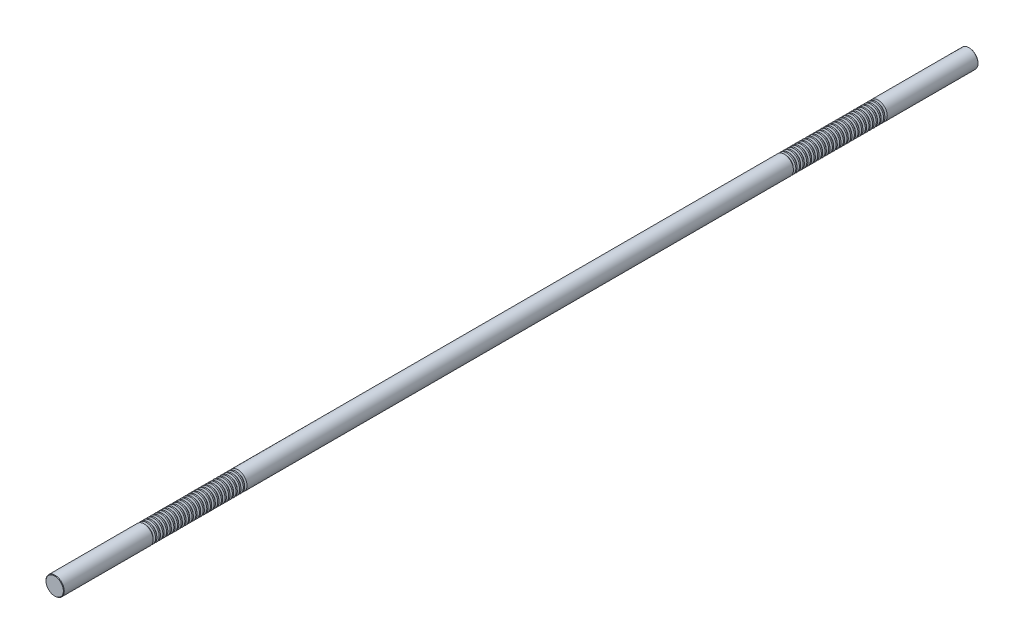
from build123d import *

# Parameters (mm, degrees)
SKETCH1_R           = 10
BOSS_EXTRUDE1_DEPTH = 500
CHAMFER1_SIZE       = 0.5
LPATTERN1_COUNT     = 26
LPATTERN1_PITCH     = 4
LPATTERN2_COUNT     = 2
LPATTERN2_PITCH     = 700


with BuildPart() as part:
    # Sketch1 → Boss-Extrude1 (new, symmetric)
    with BuildSketch(Plane.XY):
        Circle(SKETCH1_R)
    extrude(amount=BOSS_EXTRUDE1_DEPTH, both=True)

    # Chamfer1
    chamfer1_edges = [part.edges().sort_by_distance(p)[0] for p in [
        (-10, 0, -500),
        (-10, 0, 500),
    ]]
    chamfer(chamfer1_edges, length=CHAMFER1_SIZE)

    # Sketch2 → Cut-Revolve1 (revolve, cut)
    with BuildSketch(Plane(origin=(0, 0, 0), x_dir=(0, 0, -1), z_dir=(1, 0, 0)), mode=Mode.PRIVATE) as cut_revolve1_sk:
        Polygon((400.301442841, 10), (397.698557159, 10), (398.301442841, 7.75), (399.698557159, 7.75), align=None)
    cut_revolve1 = revolve(cut_revolve1_sk.sketch.rotate(Axis((0, 0, 500), (0, 0, -1)), 90), axis=Axis((0, 0, 500), (0, 0, -1)), mode=Mode.SUBTRACT)

    # LPattern1: Cut-Revolve1 ×26
    with Locations(*[(0, 0, i * LPATTERN1_PITCH) for i in range(1, LPATTERN1_COUNT)]):
        add(cut_revolve1, mode=Mode.SUBTRACT)

    # LPattern2: Cut-Revolve1 ×2
    with Locations(*[(0, 0, i * LPATTERN2_PITCH) for i in range(1, LPATTERN2_COUNT)]):
        add(cut_revolve1, mode=Mode.SUBTRACT)

    # LPattern2 copy 1 sketch → LPattern2 copy 1 (revolve, cut)
    with BuildSketch(Plane(origin=(0, 0, 704), x_dir=(0, 0, -1), z_dir=(1, 0, 0))):
        Polygon((400.301442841, 10), (397.698557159, 10), (398.301442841, 7.75), (399.698557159, 7.75), align=None)
    revolve(axis=Axis((0, 0, 1204), (0, 0, -1)), mode=Mode.SUBTRACT)

    # LPattern2 copy 2 sketch → LPattern2 copy 2 (revolve, cut)
    with BuildSketch(Plane(origin=(0, 0, 708), x_dir=(0, 0, -1), z_dir=(1, 0, 0))):
        Polygon((400.301442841, 10), (397.698557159, 10), (398.301442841, 7.75), (399.698557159, 7.75), align=None)
    revolve(axis=Axis((0, 0, 1208), (0, 0, -1)), mode=Mode.SUBTRACT)

    # LPattern2 copy 3 sketch → LPattern2 copy 3 (revolve, cut)
    with BuildSketch(Plane(origin=(0, 0, 712), x_dir=(0, 0, -1), z_dir=(1, 0, 0))):
        Polygon((400.301442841, 10), (397.698557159, 10), (398.301442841, 7.75), (399.698557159, 7.75), align=None)
    revolve(axis=Axis((0, 0, 1212), (0, 0, -1)), mode=Mode.SUBTRACT)

    # LPattern2 copy 4 sketch → LPattern2 copy 4 (revolve, cut)
    with BuildSketch(Plane(origin=(0, 0, 716), x_dir=(0, 0, -1), z_dir=(1, 0, 0))):
        Polygon((400.301442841, 10), (397.698557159, 10), (398.301442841, 7.75), (399.698557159, 7.75), align=None)
    revolve(axis=Axis((0, 0, 1216), (0, 0, -1)), mode=Mode.SUBTRACT)

    # LPattern2 copy 5 sketch → LPattern2 copy 5 (revolve, cut)
    with BuildSketch(Plane(origin=(0, 0, 720), x_dir=(0, 0, -1), z_dir=(1, 0, 0))):
        Polygon((400.301442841, 10), (397.698557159, 10), (398.301442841, 7.75), (399.698557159, 7.75), align=None)
    revolve(axis=Axis((0, 0, 1220), (0, 0, -1)), mode=Mode.SUBTRACT)

    # LPattern2 copy 6 sketch → LPattern2 copy 6 (revolve, cut)
    with BuildSketch(Plane(origin=(0, 0, 724), x_dir=(0, 0, -1), z_dir=(1, 0, 0))):
        Polygon((400.301442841, 10), (397.698557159, 10), (398.301442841, 7.75), (399.698557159, 7.75), align=None)
    revolve(axis=Axis((0, 0, 1224), (0, 0, -1)), mode=Mode.SUBTRACT)

    # LPattern2 copy 7 sketch → LPattern2 copy 7 (revolve, cut)
    with BuildSketch(Plane(origin=(0, 0, 728), x_dir=(0, 0, -1), z_dir=(1, 0, 0))):
        Polygon((400.301442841, 10), (397.698557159, 10), (398.301442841, 7.75), (399.698557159, 7.75), align=None)
    revolve(axis=Axis((0, 0, 1228), (0, 0, -1)), mode=Mode.SUBTRACT)

    # LPattern2 copy 8 sketch → LPattern2 copy 8 (revolve, cut)
    with BuildSketch(Plane(origin=(0, 0, 732), x_dir=(0, 0, -1), z_dir=(1, 0, 0))):
        Polygon((400.301442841, 10), (397.698557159, 10), (398.301442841, 7.75), (399.698557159, 7.75), align=None)
    revolve(axis=Axis((0, 0, 1232), (0, 0, -1)), mode=Mode.SUBTRACT)

    # LPattern2 copy 9 sketch → LPattern2 copy 9 (revolve, cut)
    with BuildSketch(Plane(origin=(0, 0, 736), x_dir=(0, 0, -1), z_dir=(1, 0, 0))):
        Polygon((400.301442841, 10), (397.698557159, 10), (398.301442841, 7.75), (399.698557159, 7.75), align=None)
    revolve(axis=Axis((0, 0, 1236), (0, 0, -1)), mode=Mode.SUBTRACT)

    # LPattern2 copy 10 sketch → LPattern2 copy 10 (revolve, cut)
    with BuildSketch(Plane(origin=(0, 0, 740), x_dir=(0, 0, -1), z_dir=(1, 0, 0))):
        Polygon((400.301442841, 10), (397.698557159, 10), (398.301442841, 7.75), (399.698557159, 7.75), align=None)
    revolve(axis=Axis((0, 0, 1240), (0, 0, -1)), mode=Mode.SUBTRACT)

    # LPattern2 copy 11 sketch → LPattern2 copy 11 (revolve, cut)
    with BuildSketch(Plane(origin=(0, 0, 744), x_dir=(0, 0, -1), z_dir=(1, 0, 0))):
        Polygon((400.301442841, 10), (397.698557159, 10), (398.301442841, 7.75), (399.698557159, 7.75), align=None)
    revolve(axis=Axis((0, 0, 1244), (0, 0, -1)), mode=Mode.SUBTRACT)

    # LPattern2 copy 12 sketch → LPattern2 copy 12 (revolve, cut)
    with BuildSketch(Plane(origin=(0, 0, 748), x_dir=(0, 0, -1), z_dir=(1, 0, 0))):
        Polygon((400.301442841, 10), (397.698557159, 10), (398.301442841, 7.75), (399.698557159, 7.75), align=None)
    revolve(axis=Axis((0, 0, 1248), (0, 0, -1)), mode=Mode.SUBTRACT)

    # LPattern2 copy 13 sketch → LPattern2 copy 13 (revolve, cut)
    with BuildSketch(Plane(origin=(0, 0, 752), x_dir=(0, 0, -1), z_dir=(1, 0, 0))):
        Polygon((400.301442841, 10), (397.698557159, 10), (398.301442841, 7.75), (399.698557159, 7.75), align=None)
    revolve(axis=Axis((0, 0, 1252), (0, 0, -1)), mode=Mode.SUBTRACT)

    # LPattern2 copy 14 sketch → LPattern2 copy 14 (revolve, cut)
    with BuildSketch(Plane(origin=(0, 0, 756), x_dir=(0, 0, -1), z_dir=(1, 0, 0))):
        Polygon((400.301442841, 10), (397.698557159, 10), (398.301442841, 7.75), (399.698557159, 7.75), align=None)
    revolve(axis=Axis((0, 0, 1256), (0, 0, -1)), mode=Mode.SUBTRACT)

    # LPattern2 copy 15 sketch → LPattern2 copy 15 (revolve, cut)
    with BuildSketch(Plane(origin=(0, 0, 760), x_dir=(0, 0, -1), z_dir=(1, 0, 0))):
        Polygon((400.301442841, 10), (397.698557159, 10), (398.301442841, 7.75), (399.698557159, 7.75), align=None)
    revolve(axis=Axis((0, 0, 1260), (0, 0, -1)), mode=Mode.SUBTRACT)

    # LPattern2 copy 16 sketch → LPattern2 copy 16 (revolve, cut)
    with BuildSketch(Plane(origin=(0, 0, 764), x_dir=(0, 0, -1), z_dir=(1, 0, 0))):
        Polygon((400.301442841, 10), (397.698557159, 10), (398.301442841, 7.75), (399.698557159, 7.75), align=None)
    revolve(axis=Axis((0, 0, 1264), (0, 0, -1)), mode=Mode.SUBTRACT)

    # LPattern2 copy 17 sketch → LPattern2 copy 17 (revolve, cut)
    with BuildSketch(Plane(origin=(0, 0, 768), x_dir=(0, 0, -1), z_dir=(1, 0, 0))):
        Polygon((400.301442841, 10), (397.698557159, 10), (398.301442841, 7.75), (399.698557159, 7.75), align=None)
    revolve(axis=Axis((0, 0, 1268), (0, 0, -1)), mode=Mode.SUBTRACT)

    # LPattern2 copy 18 sketch → LPattern2 copy 18 (revolve, cut)
    with BuildSketch(Plane(origin=(0, 0, 772), x_dir=(0, 0, -1), z_dir=(1, 0, 0))):
        Polygon((400.301442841, 10), (397.698557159, 10), (398.301442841, 7.75), (399.698557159, 7.75), align=None)
    revolve(axis=Axis((0, 0, 1272), (0, 0, -1)), mode=Mode.SUBTRACT)

    # LPattern2 copy 19 sketch → LPattern2 copy 19 (revolve, cut)
    with BuildSketch(Plane(origin=(0, 0, 776), x_dir=(0, 0, -1), z_dir=(1, 0, 0))):
        Polygon((400.301442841, 10), (397.698557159, 10), (398.301442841, 7.75), (399.698557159, 7.75), align=None)
    revolve(axis=Axis((0, 0, 1276), (0, 0, -1)), mode=Mode.SUBTRACT)

    # LPattern2 copy 20 sketch → LPattern2 copy 20 (revolve, cut)
    with BuildSketch(Plane(origin=(0, 0, 780), x_dir=(0, 0, -1), z_dir=(1, 0, 0))):
        Polygon((400.301442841, 10), (397.698557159, 10), (398.301442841, 7.75), (399.698557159, 7.75), align=None)
    revolve(axis=Axis((0, 0, 1280), (0, 0, -1)), mode=Mode.SUBTRACT)

    # LPattern2 copy 21 sketch → LPattern2 copy 21 (revolve, cut)
    with BuildSketch(Plane(origin=(0, 0, 784), x_dir=(0, 0, -1), z_dir=(1, 0, 0))):
        Polygon((400.301442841, 10), (397.698557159, 10), (398.301442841, 7.75), (399.698557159, 7.75), align=None)
    revolve(axis=Axis((0, 0, 1284), (0, 0, -1)), mode=Mode.SUBTRACT)

    # LPattern2 copy 22 sketch → LPattern2 copy 22 (revolve, cut)
    with BuildSketch(Plane(origin=(0, 0, 788), x_dir=(0, 0, -1), z_dir=(1, 0, 0))):
        Polygon((400.301442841, 10), (397.698557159, 10), (398.301442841, 7.75), (399.698557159, 7.75), align=None)
    revolve(axis=Axis((0, 0, 1288), (0, 0, -1)), mode=Mode.SUBTRACT)

    # LPattern2 copy 23 sketch → LPattern2 copy 23 (revolve, cut)
    with BuildSketch(Plane(origin=(0, 0, 792), x_dir=(0, 0, -1), z_dir=(1, 0, 0))):
        Polygon((400.301442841, 10), (397.698557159, 10), (398.301442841, 7.75), (399.698557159, 7.75), align=None)
    revolve(axis=Axis((0, 0, 1292), (0, 0, -1)), mode=Mode.SUBTRACT)

    # LPattern2 copy 24 sketch → LPattern2 copy 24 (revolve, cut)
    with BuildSketch(Plane(origin=(0, 0, 796), x_dir=(0, 0, -1), z_dir=(1, 0, 0))):
        Polygon((400.301442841, 10), (397.698557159, 10), (398.301442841, 7.75), (399.698557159, 7.75), align=None)
    revolve(axis=Axis((0, 0, 1296), (0, 0, -1)), mode=Mode.SUBTRACT)

    # LPattern2 copy 25 sketch → LPattern2 copy 25 (revolve, cut)
    with BuildSketch(Plane(origin=(0, 0, 800), x_dir=(0, 0, -1), z_dir=(1, 0, 0))):
        Polygon((400.301442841, 10), (397.698557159, 10), (398.301442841, 7.75), (399.698557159, 7.75), align=None)
    revolve(axis=Axis((0, 0, 1300), (0, 0, -1)), mode=Mode.SUBTRACT)


solid = part.part
